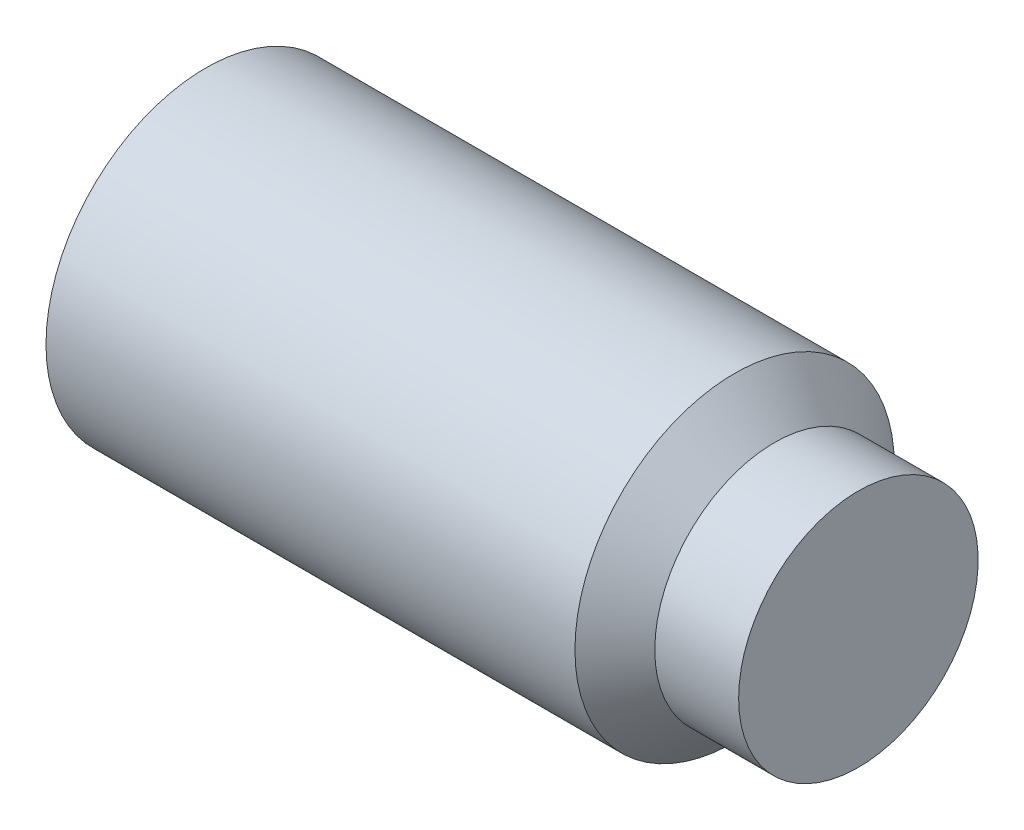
from build123d import *

# Parameters (mm, degrees)
HEX_2_DEPTH = 15


with BuildPart() as part:
    # BodySke → BaseBody (revolve)
    with BuildSketch(Plane.XY, mode=Mode.PRIVATE) as basebody_sk:
        Polygon((0, 0), (0, 10.352), (0.951473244, 12), (40.7, 12), (43.7, 9), (50, 9), (50, 0), align=None)
    revolve(basebody_sk.sketch.rotate(Axis((-12.7, 0, 0), (1, 0, 0)), 90), axis=Axis((-12.7, 0, 0), (1, 0, 0)))

    # Sketch2 → Hex 2 (cut)
    with BuildSketch(Plane.ZY):
        Polygon((3.464101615, 6), (-3.464101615, 6), (-6.92820323, 0), (-3.464101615, -6), (3.464101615, -6), (6.92820323, 0), align=None)
    extrude(amount=-HEX_2_DEPTH, mode=Mode.SUBTRACT)


solid = part.part
